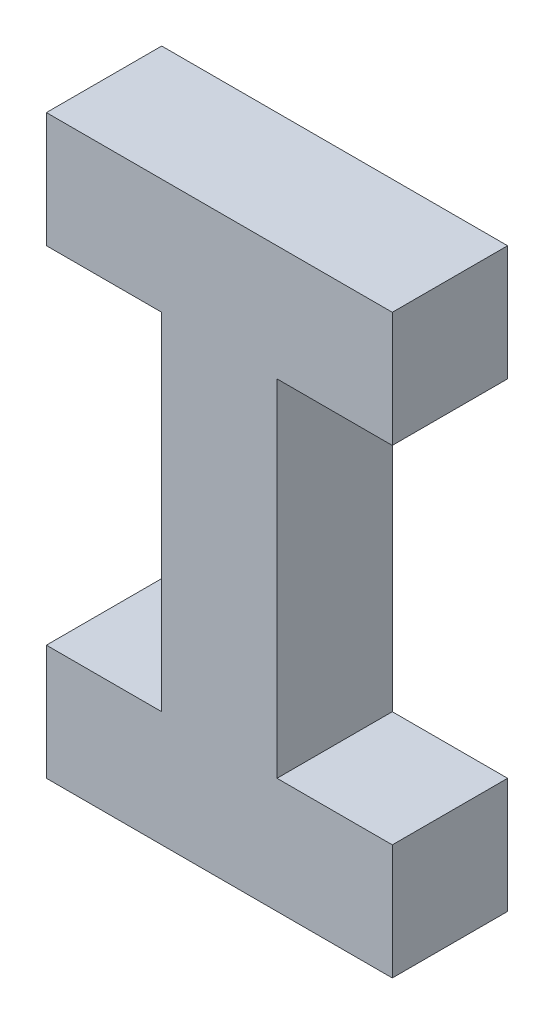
from build123d import *

# Parameters (mm, degrees)
BOSS_EXTRU_1_DEPTH = 10


with BuildPart() as part:
    # Esquisse1 → Boss.-Extru.1 (new body)
    with BuildSketch(Plane.XY):
        Polygon((20, 40), (30, 40), (30, 50), (0, 50), (0, 40), (10, 40), (10, 10), (0, 10), (0, 0), (30, 0), (30, 10), (20, 10), align=None)
    extrude(amount=BOSS_EXTRU_1_DEPTH)


solid = part.part
